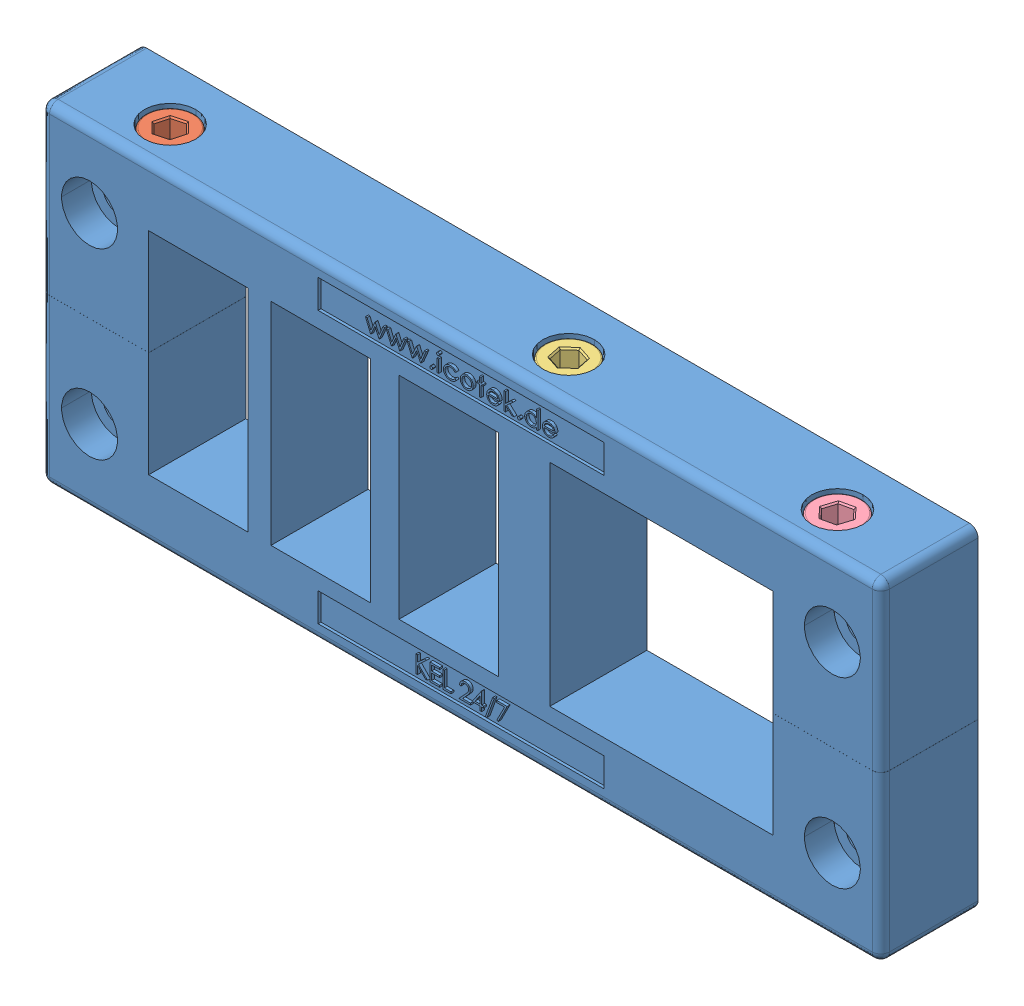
SolidWorks assembly 42247.SLDASM, configuration Default (file format 8000). Lengths in mm.
Overall size (147 58 17).
7 component instances, 7 part files, 0 mates.
Components (placement in the parent):
- 42247_01-1: 42247_01.SLDPRT [Default] at origin size (147 58 17)
- 42247_02-1: 42247_02.SLDPRT [Default] at origin size (8.5 57 8.5)
- 42247_03-1: 42247_03.SLDPRT [Default] at origin size (8.5 57 8.5)
- 42247_04-1: 42247_04.SLDPRT [Default] at origin size (8.5 57 8.5)
- 42247_05-1: 42247_05.SLDPRT [Default] at origin size (9.25 4.7 8.01)
- 42247_06-1: 42247_06.SLDPRT [Default] at origin size (9.25 4.7 8.01)
- 42247_07-1: 42247_07.SLDPRT [Default] at origin size (9.25 4.7 8.01)
